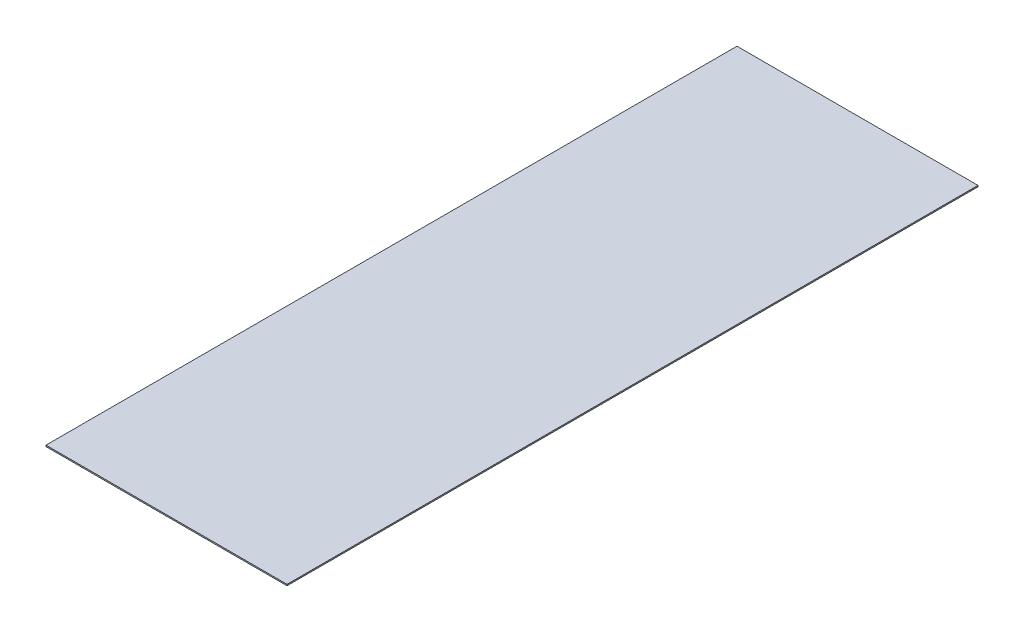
from build123d import *

# Parameters (mm, degrees)
SKETCH1_W           = 47.625
SKETCH1_H           = 136.525
BOSS_EXTRUDE1_DEPTH = 0.254


with BuildPart() as part:
    # Sketch1 → Boss-Extrude1 (new body)
    with BuildSketch(Plane(origin=(0, 0, 0), x_dir=(1, 0, 0), z_dir=(0, 1, 0))):
        with Locations((42.8625, -7.9375)):
            Rectangle(SKETCH1_W, SKETCH1_H)
    extrude(amount=BOSS_EXTRUDE1_DEPTH)


solid = part.part
